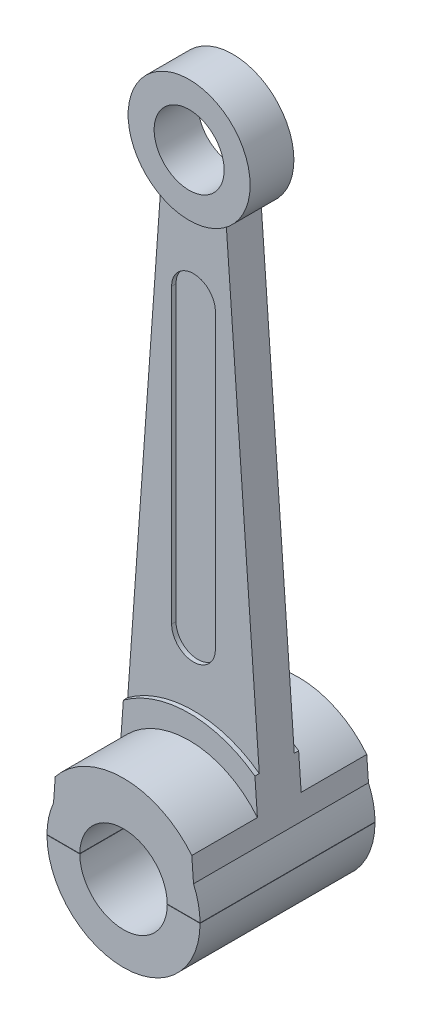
ISO-10303-21;
HEADER;
FILE_DESCRIPTION(('STEP AP214'),'2;1');
FILE_NAME('part.step','',(''),(''),'','','');
FILE_SCHEMA(('AUTOMOTIVE_DESIGN { 1 0 10303 214 1 1 1 1 }'));
ENDSEC;
DATA;
#1=APPLICATION_CONTEXT('core data for automotive mechanical design processes');
#2=APPLICATION_PROTOCOL_DEFINITION('international standard','automotive_design',2000,#1);
#3=PRODUCT_CONTEXT('',#1,'mechanical');
#4=PRODUCT('Part','Part','',(#3));
#5=PRODUCT_RELATED_PRODUCT_CATEGORY('part','',(#4));
#6=PRODUCT_DEFINITION_FORMATION('','',#4);
#7=PRODUCT_DEFINITION_CONTEXT('part definition',#1,'design');
#8=PRODUCT_DEFINITION('design','',#6,#7);
#9=PRODUCT_DEFINITION_SHAPE('','',#8);
#10=(LENGTH_UNIT() NAMED_UNIT(*) SI_UNIT(.MILLI.,.METRE.));
#11=(NAMED_UNIT(*) PLANE_ANGLE_UNIT() SI_UNIT($,.RADIAN.));
#12=(NAMED_UNIT(*) SI_UNIT($,.STERADIAN.) SOLID_ANGLE_UNIT());
#13=UNCERTAINTY_MEASURE_WITH_UNIT(LENGTH_MEASURE(1.E-05),#10,'distance_accuracy_value','');
#14=(GEOMETRIC_REPRESENTATION_CONTEXT(3) GLOBAL_UNCERTAINTY_ASSIGNED_CONTEXT((#13)) GLOBAL_UNIT_ASSIGNED_CONTEXT((#10,
#11,#12)) REPRESENTATION_CONTEXT('',''));
#15=CARTESIAN_POINT('',(0.,0.,0.));
#16=DIRECTION('',(0.,0.,1.));
#17=DIRECTION('',(1.,0.,0.));
#18=AXIS2_PLACEMENT_3D('',#15,#16,#17);
#19=CARTESIAN_POINT('',(0.,0.,-15.75));
#20=DIRECTION('',(0.,0.,1.));
#21=DIRECTION('',(1.,0.,0.));
#22=AXIS2_PLACEMENT_3D('',#19,#20,#21);
#23=CYLINDRICAL_SURFACE('',#22,1.75);
#24=CARTESIAN_POINT('',(0.,0.,-2.));
#25=DIRECTION('',(0.,0.,1.));
#26=DIRECTION('',(1.,0.,0.));
#27=AXIS2_PLACEMENT_3D('',#24,#25,#26);
#28=CIRCLE('',#27,1.75);
#29=CARTESIAN_POINT('',(-1.74998171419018,0.00799999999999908,-2.));
#30=VERTEX_POINT('',#29);
#31=CARTESIAN_POINT('',(-1.6,0.708872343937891,-2.));
#32=VERTEX_POINT('',#31);
#33=EDGE_CURVE('E265',#30,#32,#28,.F.);
#34=ORIENTED_EDGE('',*,*,#33,.F.);
#35=DIRECTION('',(0.,0.,1.));
#36=VECTOR('',#35,1.);
#37=CARTESIAN_POINT('',(-1.74998171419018,0.00799999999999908,-15.75));
#38=LINE('',#37,#36);
#39=CARTESIAN_POINT('',(-1.74998171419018,0.00799999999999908,2.));
#40=VERTEX_POINT('',#39);
#41=EDGE_CURVE('E300',#30,#40,#38,.T.);
#42=ORIENTED_EDGE('',*,*,#41,.T.);
#43=CARTESIAN_POINT('',(0.,0.,2.));
#44=DIRECTION('',(0.,0.,1.));
#45=DIRECTION('',(1.,0.,0.));
#46=AXIS2_PLACEMENT_3D('',#43,#44,#45);
#47=CIRCLE('',#46,1.75);
#48=CARTESIAN_POINT('',(-1.6,0.708872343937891,2.));
#49=VERTEX_POINT('',#48);
#50=EDGE_CURVE('E253',#40,#49,#47,.F.);
#51=ORIENTED_EDGE('',*,*,#50,.T.);
#52=DIRECTION('',(0.,0.,1.));
#53=VECTOR('',#52,1.);
#54=CARTESIAN_POINT('',(-1.6,0.708872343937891,-15.75));
#55=LINE('',#54,#53);
#56=EDGE_CURVE('E263',#32,#49,#55,.T.);
#57=ORIENTED_EDGE('',*,*,#56,.F.);
#58=EDGE_LOOP('',(#34,#42,#51,#57));
#59=FACE_BOUND('',#58,.T.);
#60=ADVANCED_FACE('F46',(#59),#23,.T.);
#61=CARTESIAN_POINT('',(0.,0.,0.5));
#62=DIRECTION('',(0.,0.,-1.));
#63=DIRECTION('',(-1.,0.,0.));
#64=AXIS2_PLACEMENT_3D('',#61,#62,#63);
#65=CYLINDRICAL_SURFACE('',#64,2.538);
#66=CARTESIAN_POINT('',(0.,0.,0.5));
#67=DIRECTION('',(0.,0.,1.));
#68=DIRECTION('',(1.,0.,0.));
#69=AXIS2_PLACEMENT_3D('',#66,#67,#68);
#70=CIRCLE('',#69,2.538);
#71=CARTESIAN_POINT('',(1.5038301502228,2.04448988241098,0.5));
#72=VERTEX_POINT('',#71);
#73=CARTESIAN_POINT('',(-1.5038301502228,2.04448988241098,0.5));
#74=VERTEX_POINT('',#73);
#75=EDGE_CURVE('E188',#72,#74,#70,.T.);
#76=ORIENTED_EDGE('',*,*,#75,.F.);
#77=DIRECTION('',(0.,0.,-1.));
#78=VECTOR('',#77,1.);
#79=CARTESIAN_POINT('',(1.5038301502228,2.04448988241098,0.5));
#80=LINE('',#79,#78);
#81=CARTESIAN_POINT('',(1.5038301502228,2.04448988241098,0.4));
#82=VERTEX_POINT('',#81);
#83=EDGE_CURVE('E250',#72,#82,#80,.T.);
#84=ORIENTED_EDGE('',*,*,#83,.T.);
#85=CARTESIAN_POINT('',(0.,0.,0.4));
#86=DIRECTION('',(0.,0.,1.));
#87=DIRECTION('',(1.,0.,0.));
#88=AXIS2_PLACEMENT_3D('',#85,#86,#87);
#89=CIRCLE('',#88,2.538);
#90=CARTESIAN_POINT('',(-1.5038301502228,2.04448988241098,0.4));
#91=VERTEX_POINT('',#90);
#92=EDGE_CURVE('E163',#82,#91,#89,.T.);
#93=ORIENTED_EDGE('',*,*,#92,.T.);
#94=DIRECTION('',(0.,0.,-1.));
#95=VECTOR('',#94,1.);
#96=CARTESIAN_POINT('',(-1.5038301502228,2.04448988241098,0.5));
#97=LINE('',#96,#95);
#98=EDGE_CURVE('E130',#91,#74,#97,.F.);
#99=ORIENTED_EDGE('',*,*,#98,.T.);
#100=EDGE_LOOP('',(#76,#84,#93,#99));
#101=FACE_BOUND('',#100,.T.);
#102=ADVANCED_FACE('F452',(#101),#65,.T.);
#103=CARTESIAN_POINT('',(0.,4.,0.4));
#104=DIRECTION('',(0.,0.,-1.));
#105=DIRECTION('',(-1.,0.,0.));
#106=AXIS2_PLACEMENT_3D('',#103,#104,#105);
#107=CYLINDRICAL_SURFACE('',#106,0.5);
#108=DIRECTION('',(0.,0.,-1.));
#109=VECTOR('',#108,1.);
#110=CARTESIAN_POINT('',(-0.499999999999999,4.,0.4));
#111=LINE('',#110,#109);
#112=CARTESIAN_POINT('',(-0.499999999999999,4.,-0.3));
#113=VERTEX_POINT('',#112);
#114=CARTESIAN_POINT('',(-0.499999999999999,4.,-0.4));
#115=VERTEX_POINT('',#114);
#116=EDGE_CURVE('E196',#113,#115,#111,.T.);
#117=ORIENTED_EDGE('',*,*,#116,.F.);
#118=CARTESIAN_POINT('',(0.,4.,-0.3));
#119=DIRECTION('',(0.,0.,1.));
#120=DIRECTION('',(1.,0.,0.));
#121=AXIS2_PLACEMENT_3D('',#118,#119,#120);
#122=CIRCLE('',#121,0.5);
#123=CARTESIAN_POINT('',(0.500000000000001,4.,-0.3));
#124=VERTEX_POINT('',#123);
#125=EDGE_CURVE('E202',#113,#124,#122,.T.);
#126=ORIENTED_EDGE('',*,*,#125,.T.);
#127=DIRECTION('',(0.,0.,-1.));
#128=VECTOR('',#127,1.);
#129=CARTESIAN_POINT('',(0.500000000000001,4.,0.4));
#130=LINE('',#129,#128);
#131=CARTESIAN_POINT('',(0.500000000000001,4.,-0.4));
#132=VERTEX_POINT('',#131);
#133=EDGE_CURVE('E205',#124,#132,#130,.T.);
#134=ORIENTED_EDGE('',*,*,#133,.T.);
#135=CARTESIAN_POINT('',(0.,4.,-0.4));
#136=DIRECTION('',(0.,0.,1.));
#137=DIRECTION('',(1.,0.,0.));
#138=AXIS2_PLACEMENT_3D('',#135,#136,#137);
#139=CIRCLE('',#138,0.5);
#140=EDGE_CURVE('E168',#115,#132,#139,.T.);
#141=ORIENTED_EDGE('',*,*,#140,.F.);
#142=EDGE_LOOP('',(#117,#126,#134,#141));
#143=FACE_BOUND('',#142,.T.);
#144=ADVANCED_FACE('F357',(#143),#107,.F.);
#145=CARTESIAN_POINT('',(-0.499999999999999,0.,0.4));
#146=DIRECTION('',(1.,0.,0.));
#147=DIRECTION('',(0.,1.,0.));
#148=AXIS2_PLACEMENT_3D('',#145,#146,#147);
#149=PLANE('',#148);
#150=DIRECTION('',(0.,0.,-1.));
#151=VECTOR('',#150,1.);
#152=CARTESIAN_POINT('',(-0.499999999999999,10.69,0.4));
#153=LINE('',#152,#151);
#154=CARTESIAN_POINT('',(-0.499999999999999,10.69,-0.3));
#155=VERTEX_POINT('',#154);
#156=CARTESIAN_POINT('',(-0.499999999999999,10.69,-0.4));
#157=VERTEX_POINT('',#156);
#158=EDGE_CURVE('E195',#155,#157,#153,.T.);
#159=ORIENTED_EDGE('',*,*,#158,.F.);
#160=DIRECTION('',(0.,-1.,0.));
#161=VECTOR('',#160,1.);
#162=CARTESIAN_POINT('',(-0.499999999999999,0.,-0.3));
#163=LINE('',#162,#161);
#164=EDGE_CURVE('E206',#155,#113,#163,.T.);
#165=ORIENTED_EDGE('',*,*,#164,.T.);
#166=ORIENTED_EDGE('',*,*,#116,.T.);
#167=DIRECTION('',(0.,-1.,0.));
#168=VECTOR('',#167,1.);
#169=CARTESIAN_POINT('',(-0.499999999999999,0.,-0.4));
#170=LINE('',#169,#168);
#171=EDGE_CURVE('E334',#157,#115,#170,.T.);
#172=ORIENTED_EDGE('',*,*,#171,.F.);
#173=EDGE_LOOP('',(#159,#165,#166,#172));
#174=FACE_BOUND('',#173,.T.);
#175=ADVANCED_FACE('F459',(#174),#149,.T.);
#176=CARTESIAN_POINT('',(0.,10.69,0.4));
#177=DIRECTION('',(0.,0.,-1.));
#178=DIRECTION('',(-1.,0.,0.));
#179=AXIS2_PLACEMENT_3D('',#176,#177,#178);
#180=CYLINDRICAL_SURFACE('',#179,0.5);
#181=DIRECTION('',(0.,0.,-1.));
#182=VECTOR('',#181,1.);
#183=CARTESIAN_POINT('',(0.5,10.69,0.4));
#184=LINE('',#183,#182);
#185=CARTESIAN_POINT('',(0.5,10.69,-0.3));
#186=VERTEX_POINT('',#185);
#187=CARTESIAN_POINT('',(0.5,10.69,-0.4));
#188=VERTEX_POINT('',#187);
#189=EDGE_CURVE('E328',#186,#188,#184,.T.);
#190=ORIENTED_EDGE('',*,*,#189,.F.);
#191=CARTESIAN_POINT('',(0.,10.69,-0.3));
#192=DIRECTION('',(0.,0.,1.));
#193=DIRECTION('',(1.,0.,0.));
#194=AXIS2_PLACEMENT_3D('',#191,#192,#193);
#195=CIRCLE('',#194,0.5);
#196=EDGE_CURVE('E192',#186,#155,#195,.T.);
#197=ORIENTED_EDGE('',*,*,#196,.T.);
#198=ORIENTED_EDGE('',*,*,#158,.T.);
#199=CARTESIAN_POINT('',(0.,10.69,-0.4));
#200=DIRECTION('',(0.,0.,1.));
#201=DIRECTION('',(1.,0.,0.));
#202=AXIS2_PLACEMENT_3D('',#199,#200,#201);
#203=CIRCLE('',#202,0.5);
#204=EDGE_CURVE('E337',#188,#157,#203,.T.);
#205=ORIENTED_EDGE('',*,*,#204,.F.);
#206=EDGE_LOOP('',(#190,#197,#198,#205));
#207=FACE_BOUND('',#206,.T.);
#208=ADVANCED_FACE('F486',(#207),#180,.F.);
#209=CARTESIAN_POINT('',(0.500000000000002,0.,0.4));
#210=DIRECTION('',(1.,0.,0.));
#211=DIRECTION('',(0.,1.,0.));
#212=AXIS2_PLACEMENT_3D('',#209,#210,#211);
#213=PLANE('',#212);
#214=DIRECTION('',(0.,-1.,0.));
#215=VECTOR('',#214,1.);
#216=CARTESIAN_POINT('',(0.500000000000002,0.,-0.3));
#217=LINE('',#216,#215);
#218=EDGE_CURVE('E197',#186,#124,#217,.T.);
#219=ORIENTED_EDGE('',*,*,#218,.F.);
#220=ORIENTED_EDGE('',*,*,#189,.T.);
#221=DIRECTION('',(0.,-1.,0.));
#222=VECTOR('',#221,1.);
#223=CARTESIAN_POINT('',(0.500000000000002,0.,-0.4));
#224=LINE('',#223,#222);
#225=EDGE_CURVE('E159',#188,#132,#224,.T.);
#226=ORIENTED_EDGE('',*,*,#225,.T.);
#227=ORIENTED_EDGE('',*,*,#133,.F.);
#228=EDGE_LOOP('',(#219,#220,#226,#227));
#229=FACE_BOUND('',#228,.T.);
#230=ADVANCED_FACE('F481',(#229),#213,.F.);
#231=CARTESIAN_POINT('',(0.,13.69,0.5));
#232=DIRECTION('',(0.,0.,-1.));
#233=DIRECTION('',(-1.,0.,0.));
#234=AXIS2_PLACEMENT_3D('',#231,#232,#233);
#235=CYLINDRICAL_SURFACE('',#234,0.8);
#236=CARTESIAN_POINT('',(0.,13.69,0.5));
#237=DIRECTION('',(0.,0.,1.));
#238=DIRECTION('',(1.,0.,0.));
#239=AXIS2_PLACEMENT_3D('',#236,#237,#238);
#240=CIRCLE('',#239,0.8);
#241=CARTESIAN_POINT('',(0.8,13.69,0.5));
#242=VERTEX_POINT('',#241);
#243=EDGE_CURVE('E154',#242,#242,#240,.T.);
#244=ORIENTED_EDGE('',*,*,#243,.T.);
#245=EDGE_LOOP('',(#244));
#246=FACE_BOUND('',#245,.T.);
#247=CARTESIAN_POINT('',(0.,13.69,-0.5));
#248=DIRECTION('',(0.,0.,1.));
#249=DIRECTION('',(1.,0.,0.));
#250=AXIS2_PLACEMENT_3D('',#247,#248,#249);
#251=CIRCLE('',#250,0.8);
#252=CARTESIAN_POINT('',(0.8,13.69,-0.5));
#253=VERTEX_POINT('',#252);
#254=EDGE_CURVE('E182',#253,#253,#251,.T.);
#255=ORIENTED_EDGE('',*,*,#254,.F.);
#256=EDGE_LOOP('',(#255));
#257=FACE_BOUND('',#256,.T.);
#258=ADVANCED_FACE('F502',(#246,#257),#235,.F.);
#259=CARTESIAN_POINT('',(0.,13.69,0.5));
#260=DIRECTION('',(0.,0.,-1.));
#261=DIRECTION('',(-1.,0.,0.));
#262=AXIS2_PLACEMENT_3D('',#259,#260,#261);
#263=CYLINDRICAL_SURFACE('',#262,1.395);
#264=CARTESIAN_POINT('',(0.,13.69,0.4));
#265=DIRECTION('',(0.,0.,1.));
#266=DIRECTION('',(1.,0.,0.));
#267=AXIS2_PLACEMENT_3D('',#264,#265,#266);
#268=CIRCLE('',#267,1.395);
#269=CARTESIAN_POINT('',(-0.75,12.5137666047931,0.400000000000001));
#270=VERTEX_POINT('',#269);
#271=CARTESIAN_POINT('',(0.75,12.5137666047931,0.400000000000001));
#272=VERTEX_POINT('',#271);
#273=EDGE_CURVE('E144',#270,#272,#268,.T.);
#274=ORIENTED_EDGE('',*,*,#273,.T.);
#275=DIRECTION('',(0.,0.,-1.));
#276=VECTOR('',#275,1.);
#277=CARTESIAN_POINT('',(0.75,12.5137666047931,0.4));
#278=LINE('',#277,#276);
#279=CARTESIAN_POINT('',(0.75,12.5137666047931,-0.399999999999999));
#280=VERTEX_POINT('',#279);
#281=EDGE_CURVE('E153',#272,#280,#278,.T.);
#282=ORIENTED_EDGE('',*,*,#281,.T.);
#283=CARTESIAN_POINT('',(0.,13.69,-0.4));
#284=DIRECTION('',(0.,0.,1.));
#285=DIRECTION('',(1.,0.,0.));
#286=AXIS2_PLACEMENT_3D('',#283,#284,#285);
#287=CIRCLE('',#286,1.395);
#288=CARTESIAN_POINT('',(-0.75,12.5137666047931,-0.399999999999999));
#289=VERTEX_POINT('',#288);
#290=EDGE_CURVE('E146',#289,#280,#287,.T.);
#291=ORIENTED_EDGE('',*,*,#290,.F.);
#292=DIRECTION('',(0.,0.,-1.));
#293=VECTOR('',#292,1.);
#294=CARTESIAN_POINT('',(-0.75,12.5137666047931,0.4));
#295=LINE('',#294,#293);
#296=EDGE_CURVE('E128',#270,#289,#295,.T.);
#297=ORIENTED_EDGE('',*,*,#296,.F.);
#298=EDGE_LOOP('',(#274,#282,#291,#297));
#299=FACE_BOUND('',#298,.T.);
#300=CARTESIAN_POINT('',(0.,13.69,-0.5));
#301=DIRECTION('',(0.,0.,1.));
#302=DIRECTION('',(1.,0.,0.));
#303=AXIS2_PLACEMENT_3D('',#300,#301,#302);
#304=CIRCLE('',#303,1.395);
#305=CARTESIAN_POINT('',(1.395,13.69,-0.5));
#306=VERTEX_POINT('',#305);
#307=EDGE_CURVE('E156',#306,#306,#304,.T.);
#308=ORIENTED_EDGE('',*,*,#307,.T.);
#309=EDGE_LOOP('',(#308));
#310=FACE_BOUND('',#309,.T.);
#311=CARTESIAN_POINT('',(0.,13.69,0.5));
#312=DIRECTION('',(0.,0.,1.));
#313=DIRECTION('',(1.,0.,0.));
#314=AXIS2_PLACEMENT_3D('',#311,#312,#313);
#315=CIRCLE('',#314,1.395);
#316=CARTESIAN_POINT('',(1.395,13.69,0.5));
#317=VERTEX_POINT('',#316);
#318=EDGE_CURVE('E317',#317,#317,#315,.T.);
#319=ORIENTED_EDGE('',*,*,#318,.F.);
#320=EDGE_LOOP('',(#319));
#321=FACE_BOUND('',#320,.T.);
#322=ADVANCED_FACE('F140',(#299,#310,#321),#263,.T.);
#323=CARTESIAN_POINT('',(0.,0.,0.5));
#324=DIRECTION('',(0.,0.,1.));
#325=DIRECTION('',(1.,0.,0.));
#326=AXIS2_PLACEMENT_3D('',#323,#324,#325);
#327=PLANE('',#326);
#328=ORIENTED_EDGE('',*,*,#243,.F.);
#329=EDGE_LOOP('',(#328));
#330=FACE_BOUND('',#329,.T.);
#331=ORIENTED_EDGE('',*,*,#318,.T.);
#332=EDGE_LOOP('',(#331));
#333=FACE_BOUND('',#332,.T.);
#334=ADVANCED_FACE('F493',(#330,#333),#327,.T.);
#335=CARTESIAN_POINT('',(0.,0.,-0.5));
#336=DIRECTION('',(0.,0.,1.));
#337=DIRECTION('',(1.,0.,0.));
#338=AXIS2_PLACEMENT_3D('',#335,#336,#337);
#339=PLANE('',#338);
#340=ORIENTED_EDGE('',*,*,#254,.T.);
#341=EDGE_LOOP('',(#340));
#342=FACE_BOUND('',#341,.T.);
#343=ORIENTED_EDGE('',*,*,#307,.F.);
#344=EDGE_LOOP('',(#343));
#345=FACE_BOUND('',#344,.T.);
#346=ADVANCED_FACE('F491',(#342,#345),#339,.F.);
#347=CARTESIAN_POINT('',(0.,4.,0.3));
#348=DIRECTION('',(0.,0.,1.));
#349=DIRECTION('',(1.,0.,0.));
#350=AXIS2_PLACEMENT_3D('',#347,#348,#349);
#351=CIRCLE('',#350,0.5);
#352=CARTESIAN_POINT('',(-0.499999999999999,4.,0.3));
#353=VERTEX_POINT('',#352);
#354=CARTESIAN_POINT('',(0.500000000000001,4.,0.3));
#355=VERTEX_POINT('',#354);
#356=EDGE_CURVE('E213',#353,#355,#351,.T.);
#357=ORIENTED_EDGE('',*,*,#356,.F.);
#358=CARTESIAN_POINT('',(-0.499999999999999,4.,0.4));
#359=VERTEX_POINT('',#358);
#360=EDGE_CURVE('E174',#359,#353,#111,.T.);
#361=ORIENTED_EDGE('',*,*,#360,.F.);
#362=CARTESIAN_POINT('',(0.,4.,0.4));
#363=DIRECTION('',(0.,0.,1.));
#364=DIRECTION('',(1.,0.,0.));
#365=AXIS2_PLACEMENT_3D('',#362,#363,#364);
#366=CIRCLE('',#365,0.5);
#367=CARTESIAN_POINT('',(0.500000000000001,4.,0.4));
#368=VERTEX_POINT('',#367);
#369=EDGE_CURVE('E179',#359,#368,#366,.T.);
#370=ORIENTED_EDGE('',*,*,#369,.T.);
#371=EDGE_CURVE('E178',#368,#355,#130,.T.);
#372=ORIENTED_EDGE('',*,*,#371,.T.);
#373=EDGE_LOOP('',(#357,#361,#370,#372));
#374=FACE_BOUND('',#373,.T.);
#375=ADVANCED_FACE('F461',(#374),#107,.F.);
#376=DIRECTION('',(0.,-1.,0.));
#377=VECTOR('',#376,1.);
#378=CARTESIAN_POINT('',(-0.499999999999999,0.,0.3));
#379=LINE('',#378,#377);
#380=CARTESIAN_POINT('',(-0.499999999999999,10.69,0.3));
#381=VERTEX_POINT('',#380);
#382=EDGE_CURVE('E200',#381,#353,#379,.T.);
#383=ORIENTED_EDGE('',*,*,#382,.F.);
#384=CARTESIAN_POINT('',(-0.499999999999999,10.69,0.4));
#385=VERTEX_POINT('',#384);
#386=EDGE_CURVE('E173',#385,#381,#153,.T.);
#387=ORIENTED_EDGE('',*,*,#386,.F.);
#388=DIRECTION('',(0.,-1.,0.));
#389=VECTOR('',#388,1.);
#390=CARTESIAN_POINT('',(-0.499999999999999,0.,0.4));
#391=LINE('',#390,#389);
#392=EDGE_CURVE('E175',#385,#359,#391,.T.);
#393=ORIENTED_EDGE('',*,*,#392,.T.);
#394=ORIENTED_EDGE('',*,*,#360,.T.);
#395=EDGE_LOOP('',(#383,#387,#393,#394));
#396=FACE_BOUND('',#395,.T.);
#397=ADVANCED_FACE('F484',(#396),#149,.T.);
#398=CARTESIAN_POINT('',(0.,10.69,0.3));
#399=DIRECTION('',(0.,0.,1.));
#400=DIRECTION('',(1.,0.,0.));
#401=AXIS2_PLACEMENT_3D('',#398,#399,#400);
#402=CIRCLE('',#401,0.5);
#403=CARTESIAN_POINT('',(0.5,10.69,0.3));
#404=VERTEX_POINT('',#403);
#405=EDGE_CURVE('E209',#404,#381,#402,.T.);
#406=ORIENTED_EDGE('',*,*,#405,.F.);
#407=CARTESIAN_POINT('',(0.5,10.69,0.4));
#408=VERTEX_POINT('',#407);
#409=EDGE_CURVE('E216',#408,#404,#184,.T.);
#410=ORIENTED_EDGE('',*,*,#409,.F.);
#411=CARTESIAN_POINT('',(0.,10.69,0.4));
#412=DIRECTION('',(0.,0.,1.));
#413=DIRECTION('',(1.,0.,0.));
#414=AXIS2_PLACEMENT_3D('',#411,#412,#413);
#415=CIRCLE('',#414,0.5);
#416=EDGE_CURVE('E170',#408,#385,#415,.T.);
#417=ORIENTED_EDGE('',*,*,#416,.T.);
#418=ORIENTED_EDGE('',*,*,#386,.T.);
#419=EDGE_LOOP('',(#406,#410,#417,#418));
#420=FACE_BOUND('',#419,.T.);
#421=ADVANCED_FACE('F479',(#420),#180,.F.);
#422=ORIENTED_EDGE('',*,*,#409,.T.);
#423=DIRECTION('',(0.,-1.,0.));
#424=VECTOR('',#423,1.);
#425=CARTESIAN_POINT('',(0.500000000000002,0.,0.3));
#426=LINE('',#425,#424);
#427=EDGE_CURVE('E169',#404,#355,#426,.T.);
#428=ORIENTED_EDGE('',*,*,#427,.T.);
#429=ORIENTED_EDGE('',*,*,#371,.F.);
#430=DIRECTION('',(0.,-1.,0.));
#431=VECTOR('',#430,1.);
#432=CARTESIAN_POINT('',(0.500000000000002,0.,0.4));
#433=LINE('',#432,#431);
#434=EDGE_CURVE('E165',#408,#368,#433,.T.);
#435=ORIENTED_EDGE('',*,*,#434,.F.);
#436=EDGE_LOOP('',(#422,#428,#429,#435));
#437=FACE_BOUND('',#436,.T.);
#438=ADVANCED_FACE('F475',(#437),#213,.F.);
#439=CARTESIAN_POINT('',(0.,0.,0.4));
#440=DIRECTION('',(0.,0.,1.));
#441=DIRECTION('',(1.,0.,0.));
#442=AXIS2_PLACEMENT_3D('',#439,#440,#441);
#443=PLANE('',#442);
#444=DIRECTION('',(0.0718181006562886,-0.997417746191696,0.));
#445=VECTOR('',#444,1.);
#446=CARTESIAN_POINT('',(1.64252585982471,0.118268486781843,0.4));
#447=LINE('',#446,#445);
#448=EDGE_CURVE('E152',#272,#82,#447,.T.);
#449=ORIENTED_EDGE('',*,*,#448,.F.);
#450=ORIENTED_EDGE('',*,*,#273,.F.);
#451=DIRECTION('',(0.0718181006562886,0.997417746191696,0.));
#452=VECTOR('',#451,1.);
#453=CARTESIAN_POINT('',(-1.64252585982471,0.118268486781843,0.4));
#454=LINE('',#453,#452);
#455=EDGE_CURVE('E125',#91,#270,#454,.T.);
#456=ORIENTED_EDGE('',*,*,#455,.F.);
#457=ORIENTED_EDGE('',*,*,#92,.F.);
#458=EDGE_LOOP('',(#449,#450,#456,#457));
#459=FACE_BOUND('',#458,.T.);
#460=ORIENTED_EDGE('',*,*,#369,.F.);
#461=ORIENTED_EDGE('',*,*,#392,.F.);
#462=ORIENTED_EDGE('',*,*,#416,.F.);
#463=ORIENTED_EDGE('',*,*,#434,.T.);
#464=EDGE_LOOP('',(#460,#461,#462,#463));
#465=FACE_BOUND('',#464,.T.);
#466=ADVANCED_FACE('F149',(#459,#465),#443,.T.);
#467=CARTESIAN_POINT('',(0.,0.,-0.4));
#468=DIRECTION('',(0.,0.,1.));
#469=DIRECTION('',(1.,0.,0.));
#470=AXIS2_PLACEMENT_3D('',#467,#468,#469);
#471=PLANE('',#470);
#472=ORIENTED_EDGE('',*,*,#140,.T.);
#473=ORIENTED_EDGE('',*,*,#225,.F.);
#474=ORIENTED_EDGE('',*,*,#204,.T.);
#475=ORIENTED_EDGE('',*,*,#171,.T.);
#476=EDGE_LOOP('',(#472,#473,#474,#475));
#477=FACE_BOUND('',#476,.T.);
#478=ORIENTED_EDGE('',*,*,#290,.T.);
#479=DIRECTION('',(0.0718181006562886,-0.997417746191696,0.));
#480=VECTOR('',#479,1.);
#481=CARTESIAN_POINT('',(1.64252585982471,0.118268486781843,-0.4));
#482=LINE('',#481,#480);
#483=CARTESIAN_POINT('',(1.5038301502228,2.04448988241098,-0.4));
#484=VERTEX_POINT('',#483);
#485=EDGE_CURVE('E231',#280,#484,#482,.T.);
#486=ORIENTED_EDGE('',*,*,#485,.T.);
#487=CARTESIAN_POINT('',(0.,0.,-0.4));
#488=DIRECTION('',(0.,0.,1.));
#489=DIRECTION('',(1.,0.,0.));
#490=AXIS2_PLACEMENT_3D('',#487,#488,#489);
#491=CIRCLE('',#490,2.538);
#492=CARTESIAN_POINT('',(-1.5038301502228,2.04448988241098,-0.4));
#493=VERTEX_POINT('',#492);
#494=EDGE_CURVE('E234',#484,#493,#491,.T.);
#495=ORIENTED_EDGE('',*,*,#494,.T.);
#496=DIRECTION('',(0.0718181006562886,0.997417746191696,0.));
#497=VECTOR('',#496,1.);
#498=CARTESIAN_POINT('',(-1.64252585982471,0.118268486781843,-0.4));
#499=LINE('',#498,#497);
#500=EDGE_CURVE('E96',#493,#289,#499,.T.);
#501=ORIENTED_EDGE('',*,*,#500,.T.);
#502=EDGE_LOOP('',(#478,#486,#495,#501));
#503=FACE_BOUND('',#502,.T.);
#504=ADVANCED_FACE('F346',(#477,#503),#471,.F.);
#505=ORIENTED_EDGE('',*,*,#494,.F.);
#506=CARTESIAN_POINT('',(1.5038301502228,2.04448988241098,-0.5));
#507=VERTEX_POINT('',#506);
#508=EDGE_CURVE('E187',#484,#507,#80,.T.);
#509=ORIENTED_EDGE('',*,*,#508,.T.);
#510=CARTESIAN_POINT('',(0.,0.,-0.5));
#511=DIRECTION('',(0.,0.,1.));
#512=DIRECTION('',(1.,0.,0.));
#513=AXIS2_PLACEMENT_3D('',#510,#511,#512);
#514=CIRCLE('',#513,2.538);
#515=CARTESIAN_POINT('',(-1.5038301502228,2.04448988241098,-0.5));
#516=VERTEX_POINT('',#515);
#517=EDGE_CURVE('E183',#507,#516,#514,.T.);
#518=ORIENTED_EDGE('',*,*,#517,.T.);
#519=EDGE_CURVE('E186',#516,#493,#97,.F.);
#520=ORIENTED_EDGE('',*,*,#519,.T.);
#521=EDGE_LOOP('',(#505,#509,#518,#520));
#522=FACE_BOUND('',#521,.T.);
#523=ADVANCED_FACE('F422',(#522),#65,.T.);
#524=CARTESIAN_POINT('',(0.,0.,0.5));
#525=DIRECTION('',(0.,0.,1.));
#526=DIRECTION('',(1.,0.,0.));
#527=AXIS2_PLACEMENT_3D('',#524,#525,#526);
#528=PLANE('',#527);
#529=DIRECTION('',(0.0718181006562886,-0.997417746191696,0.));
#530=VECTOR('',#529,1.);
#531=CARTESIAN_POINT('',(1.64252585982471,0.118268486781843,0.5));
#532=LINE('',#531,#530);
#533=CARTESIAN_POINT('',(1.56101559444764,1.25029209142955,0.5));
#534=VERTEX_POINT('',#533);
#535=EDGE_CURVE('E248',#72,#534,#532,.T.);
#536=ORIENTED_EDGE('',*,*,#535,.F.);
#537=ORIENTED_EDGE('',*,*,#75,.T.);
#538=DIRECTION('',(0.0718181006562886,0.997417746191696,0.));
#539=VECTOR('',#538,1.);
#540=CARTESIAN_POINT('',(-1.64252585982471,0.118268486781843,0.5));
#541=LINE('',#540,#539);
#542=CARTESIAN_POINT('',(-1.56101559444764,1.25029209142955,0.5));
#543=VERTEX_POINT('',#542);
#544=EDGE_CURVE('E135',#543,#74,#541,.T.);
#545=ORIENTED_EDGE('',*,*,#544,.F.);
#546=CARTESIAN_POINT('',(0.,0.,0.5));
#547=DIRECTION('',(0.,0.,1.));
#548=DIRECTION('',(1.,0.,0.));
#549=AXIS2_PLACEMENT_3D('',#546,#547,#548);
#550=CIRCLE('',#549,2.);
#551=EDGE_CURVE('E221',#534,#543,#550,.T.);
#552=ORIENTED_EDGE('',*,*,#551,.F.);
#553=EDGE_LOOP('',(#536,#537,#545,#552));
#554=FACE_BOUND('',#553,.T.);
#555=ADVANCED_FACE('F449',(#554),#528,.T.);
#556=CARTESIAN_POINT('',(0.,0.,-0.5));
#557=DIRECTION('',(0.,0.,1.));
#558=DIRECTION('',(1.,0.,0.));
#559=AXIS2_PLACEMENT_3D('',#556,#557,#558);
#560=PLANE('',#559);
#561=ORIENTED_EDGE('',*,*,#517,.F.);
#562=DIRECTION('',(0.0718181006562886,-0.997417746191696,0.));
#563=VECTOR('',#562,1.);
#564=CARTESIAN_POINT('',(1.64252585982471,0.118268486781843,-0.5));
#565=LINE('',#564,#563);
#566=CARTESIAN_POINT('',(1.56101559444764,1.25029209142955,-0.5));
#567=VERTEX_POINT('',#566);
#568=EDGE_CURVE('E191',#507,#567,#565,.T.);
#569=ORIENTED_EDGE('',*,*,#568,.T.);
#570=CARTESIAN_POINT('',(0.,0.,-0.5));
#571=DIRECTION('',(0.,0.,1.));
#572=DIRECTION('',(1.,0.,0.));
#573=AXIS2_PLACEMENT_3D('',#570,#571,#572);
#574=CIRCLE('',#573,2.);
#575=CARTESIAN_POINT('',(-1.56101559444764,1.25029209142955,-0.5));
#576=VERTEX_POINT('',#575);
#577=EDGE_CURVE('E237',#567,#576,#574,.T.);
#578=ORIENTED_EDGE('',*,*,#577,.T.);
#579=DIRECTION('',(0.0718181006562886,0.997417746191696,0.));
#580=VECTOR('',#579,1.);
#581=CARTESIAN_POINT('',(-1.64252585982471,0.118268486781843,-0.5));
#582=LINE('',#581,#580);
#583=EDGE_CURVE('E201',#576,#516,#582,.T.);
#584=ORIENTED_EDGE('',*,*,#583,.T.);
#585=EDGE_LOOP('',(#561,#569,#578,#584));
#586=FACE_BOUND('',#585,.T.);
#587=ADVANCED_FACE('F426',(#586),#560,.F.);
#588=CARTESIAN_POINT('',(0.,0.,-0.3));
#589=DIRECTION('',(0.,0.,1.));
#590=DIRECTION('',(1.,0.,0.));
#591=AXIS2_PLACEMENT_3D('',#588,#589,#590);
#592=PLANE('',#591);
#593=ORIENTED_EDGE('',*,*,#164,.F.);
#594=ORIENTED_EDGE('',*,*,#196,.F.);
#595=ORIENTED_EDGE('',*,*,#218,.T.);
#596=ORIENTED_EDGE('',*,*,#125,.F.);
#597=EDGE_LOOP('',(#593,#594,#595,#596));
#598=FACE_BOUND('',#597,.T.);
#599=ADVANCED_FACE('F531',(#598),#592,.F.);
#600=CARTESIAN_POINT('',(0.,0.,0.3));
#601=DIRECTION('',(0.,0.,1.));
#602=DIRECTION('',(1.,0.,0.));
#603=AXIS2_PLACEMENT_3D('',#600,#601,#602);
#604=PLANE('',#603);
#605=ORIENTED_EDGE('',*,*,#382,.T.);
#606=ORIENTED_EDGE('',*,*,#356,.T.);
#607=ORIENTED_EDGE('',*,*,#427,.F.);
#608=ORIENTED_EDGE('',*,*,#405,.T.);
#609=EDGE_LOOP('',(#605,#606,#607,#608));
#610=FACE_BOUND('',#609,.T.);
#611=ADVANCED_FACE('F627',(#610),#604,.T.);
#612=CARTESIAN_POINT('',(0.,0.,-2.));
#613=DIRECTION('',(0.,0.,1.));
#614=DIRECTION('',(1.,0.,0.));
#615=AXIS2_PLACEMENT_3D('',#612,#613,#614);
#616=CYLINDRICAL_SURFACE('',#615,2.);
#617=DIRECTION('',(0.,0.,1.));
#618=VECTOR('',#617,1.);
#619=CARTESIAN_POINT('',(1.56101559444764,1.25029209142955,-2.));
#620=LINE('',#619,#618);
#621=CARTESIAN_POINT('',(1.56101559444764,1.25029209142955,-2.));
#622=VERTEX_POINT('',#621);
#623=EDGE_CURVE('E238',#622,#567,#620,.T.);
#624=ORIENTED_EDGE('',*,*,#623,.F.);
#625=CARTESIAN_POINT('',(0.,0.,-2.));
#626=DIRECTION('',(0.,0.,1.));
#627=DIRECTION('',(1.,0.,0.));
#628=AXIS2_PLACEMENT_3D('',#625,#626,#627);
#629=CIRCLE('',#628,2.);
#630=CARTESIAN_POINT('',(-1.56101559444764,1.25029209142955,-2.));
#631=VERTEX_POINT('',#630);
#632=EDGE_CURVE('E212',#622,#631,#629,.T.);
#633=ORIENTED_EDGE('',*,*,#632,.T.);
#634=DIRECTION('',(0.,0.,1.));
#635=VECTOR('',#634,1.);
#636=CARTESIAN_POINT('',(-1.56101559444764,1.25029209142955,-2.));
#637=LINE('',#636,#635);
#638=EDGE_CURVE('E241',#576,#631,#637,.F.);
#639=ORIENTED_EDGE('',*,*,#638,.F.);
#640=ORIENTED_EDGE('',*,*,#577,.F.);
#641=EDGE_LOOP('',(#624,#633,#639,#640));
#642=FACE_BOUND('',#641,.T.);
#643=ADVANCED_FACE('F430',(#642),#616,.T.);
#644=CARTESIAN_POINT('',(0.,0.,-2.));
#645=DIRECTION('',(0.,0.,1.));
#646=DIRECTION('',(1.,0.,0.));
#647=AXIS2_PLACEMENT_3D('',#644,#645,#646);
#648=PLANE('',#647);
#649=CARTESIAN_POINT('',(1.6,0.708872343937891,-2.));
#650=VERTEX_POINT('',#649);
#651=CARTESIAN_POINT('',(1.74998171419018,0.00799999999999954,-2.));
#652=VERTEX_POINT('',#651);
#653=EDGE_CURVE('E50',#650,#652,#28,.F.);
#654=ORIENTED_EDGE('',*,*,#653,.T.);
#655=DIRECTION('',(-1.,0.,0.));
#656=VECTOR('',#655,1.);
#657=CARTESIAN_POINT('',(0.,0.00799999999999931,-2.));
#658=LINE('',#657,#656);
#659=CARTESIAN_POINT('',(0.999967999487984,0.00799999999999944,-2.));
#660=VERTEX_POINT('',#659);
#661=EDGE_CURVE('E278',#652,#660,#658,.T.);
#662=ORIENTED_EDGE('',*,*,#661,.T.);
#663=CARTESIAN_POINT('',(0.,0.,-2.));
#664=DIRECTION('',(0.,0.,1.));
#665=DIRECTION('',(1.,0.,0.));
#666=AXIS2_PLACEMENT_3D('',#663,#664,#665);
#667=CIRCLE('',#666,1.);
#668=CARTESIAN_POINT('',(-0.999967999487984,0.00799999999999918,-2.));
#669=VERTEX_POINT('',#668);
#670=EDGE_CURVE('E281',#660,#669,#667,.T.);
#671=ORIENTED_EDGE('',*,*,#670,.T.);
#672=EDGE_CURVE('E66',#669,#30,#658,.T.);
#673=ORIENTED_EDGE('',*,*,#672,.T.);
#674=ORIENTED_EDGE('',*,*,#33,.T.);
#675=DIRECTION('',(0.0718181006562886,0.997417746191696,0.));
#676=VECTOR('',#675,1.);
#677=CARTESIAN_POINT('',(-1.64252585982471,0.118268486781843,-2.));
#678=LINE('',#677,#676);
#679=EDGE_CURVE('E246',#32,#631,#678,.T.);
#680=ORIENTED_EDGE('',*,*,#679,.T.);
#681=ORIENTED_EDGE('',*,*,#632,.F.);
#682=DIRECTION('',(0.0718181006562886,-0.997417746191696,0.));
#683=VECTOR('',#682,1.);
#684=CARTESIAN_POINT('',(1.64252585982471,0.118268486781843,-2.));
#685=LINE('',#684,#683);
#686=EDGE_CURVE('E243',#622,#650,#685,.T.);
#687=ORIENTED_EDGE('',*,*,#686,.T.);
#688=EDGE_LOOP('',(#654,#662,#671,#673,#674,#680,#681,#687));
#689=FACE_BOUND('',#688,.T.);
#690=ADVANCED_FACE('F48',(#689),#648,.F.);
#691=CARTESIAN_POINT('',(0.,0.,0.5));
#692=DIRECTION('',(0.,0.,-1.));
#693=DIRECTION('',(-1.,0.,0.));
#694=AXIS2_PLACEMENT_3D('',#691,#692,#693);
#695=CYLINDRICAL_SURFACE('',#694,1.);
#696=DIRECTION('',(0.,0.,-1.));
#697=VECTOR('',#696,1.);
#698=CARTESIAN_POINT('',(0.999967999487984,0.00799999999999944,0.5));
#699=LINE('',#698,#697);
#700=CARTESIAN_POINT('',(0.999967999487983,0.00799999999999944,2.));
#701=VERTEX_POINT('',#700);
#702=EDGE_CURVE('E277',#701,#660,#699,.T.);
#703=ORIENTED_EDGE('',*,*,#702,.F.);
#704=CARTESIAN_POINT('',(0.,0.,2.));
#705=DIRECTION('',(0.,0.,1.));
#706=DIRECTION('',(1.,0.,0.));
#707=AXIS2_PLACEMENT_3D('',#704,#705,#706);
#708=CIRCLE('',#707,1.);
#709=CARTESIAN_POINT('',(-0.999967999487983,0.00799999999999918,2.));
#710=VERTEX_POINT('',#709);
#711=EDGE_CURVE('E225',#701,#710,#708,.T.);
#712=ORIENTED_EDGE('',*,*,#711,.T.);
#713=DIRECTION('',(0.,0.,-1.));
#714=VECTOR('',#713,1.);
#715=CARTESIAN_POINT('',(-0.999967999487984,0.00799999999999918,0.5));
#716=LINE('',#715,#714);
#717=EDGE_CURVE('E56',#669,#710,#716,.F.);
#718=ORIENTED_EDGE('',*,*,#717,.F.);
#719=ORIENTED_EDGE('',*,*,#670,.F.);
#720=EDGE_LOOP('',(#703,#712,#718,#719));
#721=FACE_BOUND('',#720,.T.);
#722=ADVANCED_FACE('F289',(#721),#695,.F.);
#723=DIRECTION('',(0.,0.,1.));
#724=VECTOR('',#723,1.);
#725=CARTESIAN_POINT('',(1.56101559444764,1.25029209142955,-2.));
#726=LINE('',#725,#724);
#727=CARTESIAN_POINT('',(1.56101559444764,1.25029209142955,2.));
#728=VERTEX_POINT('',#727);
#729=EDGE_CURVE('E256',#534,#728,#726,.T.);
#730=ORIENTED_EDGE('',*,*,#729,.F.);
#731=ORIENTED_EDGE('',*,*,#551,.T.);
#732=DIRECTION('',(0.,0.,1.));
#733=VECTOR('',#732,1.);
#734=CARTESIAN_POINT('',(-1.56101559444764,1.25029209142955,-2.));
#735=LINE('',#734,#733);
#736=CARTESIAN_POINT('',(-1.56101559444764,1.25029209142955,2.));
#737=VERTEX_POINT('',#736);
#738=EDGE_CURVE('E269',#737,#543,#735,.F.);
#739=ORIENTED_EDGE('',*,*,#738,.F.);
#740=CARTESIAN_POINT('',(0.,0.,2.));
#741=DIRECTION('',(0.,0.,1.));
#742=DIRECTION('',(1.,0.,0.));
#743=AXIS2_PLACEMENT_3D('',#740,#741,#742);
#744=CIRCLE('',#743,2.);
#745=EDGE_CURVE('E224',#728,#737,#744,.T.);
#746=ORIENTED_EDGE('',*,*,#745,.F.);
#747=EDGE_LOOP('',(#730,#731,#739,#746));
#748=FACE_BOUND('',#747,.T.);
#749=ADVANCED_FACE('F444',(#748),#616,.T.);
#750=CARTESIAN_POINT('',(0.,0.,2.));
#751=DIRECTION('',(0.,0.,1.));
#752=DIRECTION('',(1.,0.,0.));
#753=AXIS2_PLACEMENT_3D('',#750,#751,#752);
#754=PLANE('',#753);
#755=DIRECTION('',(-1.,0.,0.));
#756=VECTOR('',#755,1.);
#757=CARTESIAN_POINT('',(0.,0.00799999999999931,2.));
#758=LINE('',#757,#756);
#759=CARTESIAN_POINT('',(1.74998171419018,0.00799999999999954,2.));
#760=VERTEX_POINT('',#759);
#761=EDGE_CURVE('E58',#760,#701,#758,.T.);
#762=ORIENTED_EDGE('',*,*,#761,.F.);
#763=CARTESIAN_POINT('',(1.6,0.708872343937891,2.));
#764=VERTEX_POINT('',#763);
#765=EDGE_CURVE('E230',#764,#760,#47,.F.);
#766=ORIENTED_EDGE('',*,*,#765,.F.);
#767=DIRECTION('',(0.0718181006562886,-0.997417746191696,0.));
#768=VECTOR('',#767,1.);
#769=CARTESIAN_POINT('',(1.64252585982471,0.118268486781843,2.));
#770=LINE('',#769,#768);
#771=EDGE_CURVE('E242',#728,#764,#770,.T.);
#772=ORIENTED_EDGE('',*,*,#771,.F.);
#773=ORIENTED_EDGE('',*,*,#745,.T.);
#774=DIRECTION('',(0.0718181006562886,0.997417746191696,0.));
#775=VECTOR('',#774,1.);
#776=CARTESIAN_POINT('',(-1.64252585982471,0.118268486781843,2.));
#777=LINE('',#776,#775);
#778=EDGE_CURVE('E271',#49,#737,#777,.T.);
#779=ORIENTED_EDGE('',*,*,#778,.F.);
#780=ORIENTED_EDGE('',*,*,#50,.F.);
#781=EDGE_CURVE('E12',#710,#40,#758,.T.);
#782=ORIENTED_EDGE('',*,*,#781,.F.);
#783=ORIENTED_EDGE('',*,*,#711,.F.);
#784=EDGE_LOOP('',(#762,#766,#772,#773,#779,#780,#782,#783));
#785=FACE_BOUND('',#784,.T.);
#786=ADVANCED_FACE('F293',(#785),#754,.T.);
#787=ORIENTED_EDGE('',*,*,#765,.T.);
#788=DIRECTION('',(0.,0.,1.));
#789=VECTOR('',#788,1.);
#790=CARTESIAN_POINT('',(1.74998171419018,0.00799999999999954,-15.75));
#791=LINE('',#790,#789);
#792=EDGE_CURVE('E88',#760,#652,#791,.F.);
#793=ORIENTED_EDGE('',*,*,#792,.T.);
#794=ORIENTED_EDGE('',*,*,#653,.F.);
#795=DIRECTION('',(0.,0.,1.));
#796=VECTOR('',#795,1.);
#797=CARTESIAN_POINT('',(1.6,0.708872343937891,-15.75));
#798=LINE('',#797,#796);
#799=EDGE_CURVE('E249',#650,#764,#798,.T.);
#800=ORIENTED_EDGE('',*,*,#799,.T.);
#801=EDGE_LOOP('',(#787,#793,#794,#800));
#802=FACE_BOUND('',#801,.T.);
#803=ADVANCED_FACE('F438',(#802),#23,.T.);
#804=CARTESIAN_POINT('',(1.6,0.708872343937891,-15.75));
#805=DIRECTION('',(-0.997417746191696,-0.0718181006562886,0.));
#806=DIRECTION('',(0.0718181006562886,-0.997417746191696,0.));
#807=AXIS2_PLACEMENT_3D('',#804,#805,#806);
#808=PLANE('',#807);
#809=ORIENTED_EDGE('',*,*,#281,.F.);
#810=ORIENTED_EDGE('',*,*,#448,.T.);
#811=ORIENTED_EDGE('',*,*,#83,.F.);
#812=ORIENTED_EDGE('',*,*,#535,.T.);
#813=ORIENTED_EDGE('',*,*,#729,.T.);
#814=ORIENTED_EDGE('',*,*,#771,.T.);
#815=ORIENTED_EDGE('',*,*,#799,.F.);
#816=ORIENTED_EDGE('',*,*,#686,.F.);
#817=ORIENTED_EDGE('',*,*,#623,.T.);
#818=ORIENTED_EDGE('',*,*,#568,.F.);
#819=ORIENTED_EDGE('',*,*,#508,.F.);
#820=ORIENTED_EDGE('',*,*,#485,.F.);
#821=EDGE_LOOP('',(#809,#810,#811,#812,#813,#814,#815,#816,#817,#818,#819,#820));
#822=FACE_BOUND('',#821,.T.);
#823=ADVANCED_FACE('F418',(#822),#808,.F.);
#824=CARTESIAN_POINT('',(-0.75,12.5137666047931,-15.75));
#825=DIRECTION('',(0.997417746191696,-0.0718181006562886,0.));
#826=DIRECTION('',(0.0718181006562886,0.997417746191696,0.));
#827=AXIS2_PLACEMENT_3D('',#824,#825,#826);
#828=PLANE('',#827);
#829=ORIENTED_EDGE('',*,*,#519,.F.);
#830=ORIENTED_EDGE('',*,*,#583,.F.);
#831=ORIENTED_EDGE('',*,*,#638,.T.);
#832=ORIENTED_EDGE('',*,*,#679,.F.);
#833=ORIENTED_EDGE('',*,*,#56,.T.);
#834=ORIENTED_EDGE('',*,*,#778,.T.);
#835=ORIENTED_EDGE('',*,*,#738,.T.);
#836=ORIENTED_EDGE('',*,*,#544,.T.);
#837=ORIENTED_EDGE('',*,*,#98,.F.);
#838=ORIENTED_EDGE('',*,*,#455,.T.);
#839=ORIENTED_EDGE('',*,*,#296,.T.);
#840=ORIENTED_EDGE('',*,*,#500,.F.);
#841=EDGE_LOOP('',(#829,#830,#831,#832,#833,#834,#835,#836,#837,#838,#839,#840));
#842=FACE_BOUND('',#841,.T.);
#843=ADVANCED_FACE('F127',(#842),#828,.F.);
#844=CARTESIAN_POINT('',(6.68759326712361,0.00800000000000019,-15.75));
#845=DIRECTION('',(0.,1.,0.));
#846=DIRECTION('',(-1.,0.,0.));
#847=AXIS2_PLACEMENT_3D('',#844,#845,#846);
#848=PLANE('',#847);
#849=ORIENTED_EDGE('',*,*,#792,.F.);
#850=ORIENTED_EDGE('',*,*,#761,.T.);
#851=ORIENTED_EDGE('',*,*,#702,.T.);
#852=ORIENTED_EDGE('',*,*,#661,.F.);
#853=EDGE_LOOP('',(#849,#850,#851,#852));
#854=FACE_BOUND('',#853,.T.);
#855=ADVANCED_FACE('F698',(#854),#848,.F.);
#856=ORIENTED_EDGE('',*,*,#717,.T.);
#857=ORIENTED_EDGE('',*,*,#781,.T.);
#858=ORIENTED_EDGE('',*,*,#41,.F.);
#859=ORIENTED_EDGE('',*,*,#672,.F.);
#860=EDGE_LOOP('',(#856,#857,#858,#859));
#861=FACE_BOUND('',#860,.T.);
#862=ADVANCED_FACE('F299',(#861),#848,.F.);
#863=CLOSED_SHELL('',(#60,#102,#144,#175,#208,#230,#258,#322,#334,#346,#375,#397,#421,#438,#466,
#504,#523,#555,#587,#599,#611,#643,#690,#722,#749,#786,#803,#823,#843,#855,#862));
#864=MANIFOLD_SOLID_BREP('B2',#863);
#865=CARTESIAN_POINT('',(0.,0.,-15.75));
#866=DIRECTION('',(0.,0.,1.));
#867=DIRECTION('',(1.,0.,0.));
#868=AXIS2_PLACEMENT_3D('',#865,#866,#867);
#869=CYLINDRICAL_SURFACE('',#868,1.75);
#870=CARTESIAN_POINT('',(0.,0.,-2.));
#871=DIRECTION('',(0.,0.,1.));
#872=DIRECTION('',(1.,0.,0.));
#873=AXIS2_PLACEMENT_3D('',#870,#871,#872);
#874=CIRCLE('',#873,1.75);
#875=CARTESIAN_POINT('',(1.75,0.,-2.));
#876=VERTEX_POINT('',#875);
#877=CARTESIAN_POINT('',(-1.75,0.,-2.));
#878=VERTEX_POINT('',#877);
#879=EDGE_CURVE('E807',#876,#878,#874,.F.);
#880=ORIENTED_EDGE('',*,*,#879,.F.);
#881=DIRECTION('',(0.,0.,1.));
#882=VECTOR('',#881,1.);
#883=CARTESIAN_POINT('',(1.75,0.,-15.75));
#884=LINE('',#883,#882);
#885=CARTESIAN_POINT('',(1.75,0.,2.));
#886=VERTEX_POINT('',#885);
#887=EDGE_CURVE('E44',#876,#886,#884,.T.);
#888=ORIENTED_EDGE('',*,*,#887,.T.);
#889=CARTESIAN_POINT('',(0.,0.,2.));
#890=DIRECTION('',(0.,0.,1.));
#891=DIRECTION('',(1.,0.,0.));
#892=AXIS2_PLACEMENT_3D('',#889,#890,#891);
#893=CIRCLE('',#892,1.75);
#894=CARTESIAN_POINT('',(-1.75,0.,2.));
#895=VERTEX_POINT('',#894);
#896=EDGE_CURVE('E792',#886,#895,#893,.F.);
#897=ORIENTED_EDGE('',*,*,#896,.T.);
#898=DIRECTION('',(0.,0.,1.));
#899=VECTOR('',#898,1.);
#900=CARTESIAN_POINT('',(-1.75,0.,-15.75));
#901=LINE('',#900,#899);
#902=EDGE_CURVE('E755',#895,#878,#901,.F.);
#903=ORIENTED_EDGE('',*,*,#902,.T.);
#904=EDGE_LOOP('',(#880,#888,#897,#903));
#905=FACE_BOUND('',#904,.T.);
#906=ADVANCED_FACE('F747',(#905),#869,.T.);
#907=CARTESIAN_POINT('',(0.,0.,2.));
#908=DIRECTION('',(0.,0.,1.));
#909=DIRECTION('',(1.,0.,0.));
#910=AXIS2_PLACEMENT_3D('',#907,#908,#909);
#911=PLANE('',#910);
#912=DIRECTION('',(1.,0.,0.));
#913=VECTOR('',#912,1.);
#914=CARTESIAN_POINT('',(0.,0.,2.));
#915=LINE('',#914,#913);
#916=CARTESIAN_POINT('',(-1.,0.,2.));
#917=VERTEX_POINT('',#916);
#918=EDGE_CURVE('E786',#895,#917,#915,.T.);
#919=ORIENTED_EDGE('',*,*,#918,.F.);
#920=ORIENTED_EDGE('',*,*,#896,.F.);
#921=CARTESIAN_POINT('',(1.,0.,2.));
#922=VERTEX_POINT('',#921);
#923=EDGE_CURVE('E770',#922,#886,#915,.T.);
#924=ORIENTED_EDGE('',*,*,#923,.F.);
#925=CARTESIAN_POINT('',(0.,0.,2.));
#926=DIRECTION('',(0.,0.,1.));
#927=DIRECTION('',(1.,0.,0.));
#928=AXIS2_PLACEMENT_3D('',#925,#926,#927);
#929=CIRCLE('',#928,1.);
#930=EDGE_CURVE('E798',#917,#922,#929,.T.);
#931=ORIENTED_EDGE('',*,*,#930,.F.);
#932=EDGE_LOOP('',(#919,#920,#924,#931));
#933=FACE_BOUND('',#932,.T.);
#934=ADVANCED_FACE('F796',(#933),#911,.T.);
#935=CARTESIAN_POINT('',(0.,0.,0.5));
#936=DIRECTION('',(0.,0.,-1.));
#937=DIRECTION('',(-1.,0.,0.));
#938=AXIS2_PLACEMENT_3D('',#935,#936,#937);
#939=CYLINDRICAL_SURFACE('',#938,1.);
#940=DIRECTION('',(0.,0.,-1.));
#941=VECTOR('',#940,1.);
#942=CARTESIAN_POINT('',(-1.,0.,0.5));
#943=LINE('',#942,#941);
#944=CARTESIAN_POINT('',(-1.,0.,-2.));
#945=VERTEX_POINT('',#944);
#946=EDGE_CURVE('E799',#917,#945,#943,.T.);
#947=ORIENTED_EDGE('',*,*,#946,.F.);
#948=ORIENTED_EDGE('',*,*,#930,.T.);
#949=DIRECTION('',(0.,0.,-1.));
#950=VECTOR('',#949,1.);
#951=CARTESIAN_POINT('',(1.,0.,0.5));
#952=LINE('',#951,#950);
#953=CARTESIAN_POINT('',(1.,0.,-2.));
#954=VERTEX_POINT('',#953);
#955=EDGE_CURVE('E810',#954,#922,#952,.F.);
#956=ORIENTED_EDGE('',*,*,#955,.F.);
#957=CARTESIAN_POINT('',(0.,0.,-2.));
#958=DIRECTION('',(0.,0.,1.));
#959=DIRECTION('',(1.,0.,0.));
#960=AXIS2_PLACEMENT_3D('',#957,#958,#959);
#961=CIRCLE('',#960,1.);
#962=EDGE_CURVE('E801',#945,#954,#961,.T.);
#963=ORIENTED_EDGE('',*,*,#962,.F.);
#964=EDGE_LOOP('',(#947,#948,#956,#963));
#965=FACE_BOUND('',#964,.T.);
#966=ADVANCED_FACE('F749',(#965),#939,.F.);
#967=CARTESIAN_POINT('',(0.,0.,-2.));
#968=DIRECTION('',(0.,0.,1.));
#969=DIRECTION('',(1.,0.,0.));
#970=AXIS2_PLACEMENT_3D('',#967,#968,#969);
#971=PLANE('',#970);
#972=ORIENTED_EDGE('',*,*,#879,.T.);
#973=DIRECTION('',(1.,0.,0.));
#974=VECTOR('',#973,1.);
#975=CARTESIAN_POINT('',(0.,0.,-2.));
#976=LINE('',#975,#974);
#977=EDGE_CURVE('E762',#878,#945,#976,.T.);
#978=ORIENTED_EDGE('',*,*,#977,.T.);
#979=ORIENTED_EDGE('',*,*,#962,.T.);
#980=EDGE_CURVE('E809',#954,#876,#976,.T.);
#981=ORIENTED_EDGE('',*,*,#980,.T.);
#982=EDGE_LOOP('',(#972,#978,#979,#981));
#983=FACE_BOUND('',#982,.T.);
#984=ADVANCED_FACE('F816',(#983),#971,.F.);
#985=CARTESIAN_POINT('',(6.68759326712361,0.,-15.75));
#986=DIRECTION('',(0.,-1.,0.));
#987=DIRECTION('',(0.,0.,-1.));
#988=AXIS2_PLACEMENT_3D('',#985,#986,#987);
#989=PLANE('',#988);
#990=ORIENTED_EDGE('',*,*,#902,.F.);
#991=ORIENTED_EDGE('',*,*,#918,.T.);
#992=ORIENTED_EDGE('',*,*,#946,.T.);
#993=ORIENTED_EDGE('',*,*,#977,.F.);
#994=EDGE_LOOP('',(#990,#991,#992,#993));
#995=FACE_BOUND('',#994,.T.);
#996=ADVANCED_FACE('F785',(#995),#989,.F.);
#997=ORIENTED_EDGE('',*,*,#955,.T.);
#998=ORIENTED_EDGE('',*,*,#923,.T.);
#999=ORIENTED_EDGE('',*,*,#887,.F.);
#1000=ORIENTED_EDGE('',*,*,#980,.F.);
#1001=EDGE_LOOP('',(#997,#998,#999,#1000));
#1002=FACE_BOUND('',#1001,.T.);
#1003=ADVANCED_FACE('F819',(#1002),#989,.F.);
#1004=CLOSED_SHELL('',(#906,#934,#966,#984,#996,#1003));
#1005=MANIFOLD_SOLID_BREP('B6',#1004);
#1006=ADVANCED_BREP_SHAPE_REPRESENTATION('',(#18,#864,#1005),#14);
#1007=SHAPE_DEFINITION_REPRESENTATION(#9,#1006);
ENDSEC;
END-ISO-10303-21;
